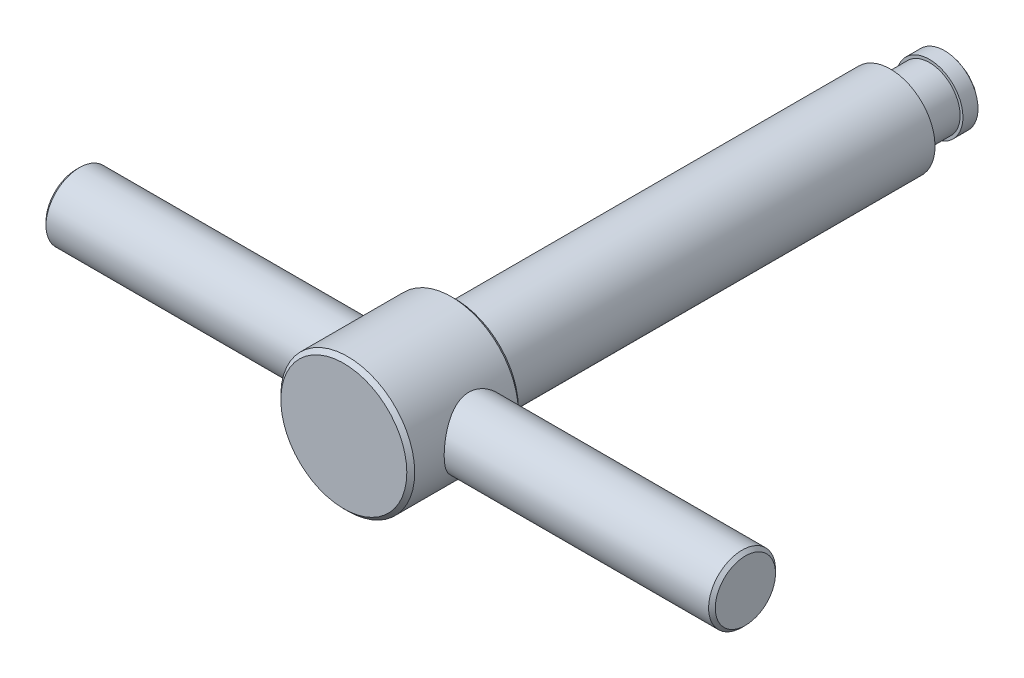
ISO-10303-21;
HEADER;
FILE_DESCRIPTION(('STEP AP214'),'2;1');
FILE_NAME('part.step','',(''),(''),'','','');
FILE_SCHEMA(('AUTOMOTIVE_DESIGN { 1 0 10303 214 1 1 1 1 }'));
ENDSEC;
DATA;
#1=APPLICATION_CONTEXT('core data for automotive mechanical design processes');
#2=APPLICATION_PROTOCOL_DEFINITION('international standard','automotive_design',2000,#1);
#3=PRODUCT_CONTEXT('',#1,'mechanical');
#4=PRODUCT('Part','Part','',(#3));
#5=PRODUCT_RELATED_PRODUCT_CATEGORY('part','',(#4));
#6=PRODUCT_DEFINITION_FORMATION('','',#4);
#7=PRODUCT_DEFINITION_CONTEXT('part definition',#1,'design');
#8=PRODUCT_DEFINITION('design','',#6,#7);
#9=PRODUCT_DEFINITION_SHAPE('','',#8);
#10=(LENGTH_UNIT() NAMED_UNIT(*) SI_UNIT(.MILLI.,.METRE.));
#11=(NAMED_UNIT(*) PLANE_ANGLE_UNIT() SI_UNIT($,.RADIAN.));
#12=(NAMED_UNIT(*) SI_UNIT($,.STERADIAN.) SOLID_ANGLE_UNIT());
#13=UNCERTAINTY_MEASURE_WITH_UNIT(LENGTH_MEASURE(1.E-05),#10,'distance_accuracy_value','');
#14=(GEOMETRIC_REPRESENTATION_CONTEXT(3) GLOBAL_UNCERTAINTY_ASSIGNED_CONTEXT((#13)) GLOBAL_UNIT_ASSIGNED_CONTEXT((#10,
#11,#12)) REPRESENTATION_CONTEXT('',''));
#15=CARTESIAN_POINT('',(0.,0.,0.));
#16=DIRECTION('',(0.,0.,1.));
#17=DIRECTION('',(1.,0.,0.));
#18=AXIS2_PLACEMENT_3D('',#15,#16,#17);
#19=CARTESIAN_POINT('',(60.,0.,103.4));
#20=DIRECTION('',(-1.,0.,0.));
#21=DIRECTION('',(0.,-1.,0.));
#22=AXIS2_PLACEMENT_3D('',#19,#20,#21);
#23=PLANE('',#22);
#24=CARTESIAN_POINT('',(60.0000000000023,0.,98.));
#25=DIRECTION('',(-1.,0.,0.));
#26=DIRECTION('',(0.,-1.,0.));
#27=AXIS2_PLACEMENT_3D('',#24,#25,#26);
#28=CIRCLE('',#27,5.40000000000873);
#29=CARTESIAN_POINT('',(60.0000000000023,-5.40000000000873,98.));
#30=VERTEX_POINT('',#29);
#31=EDGE_CURVE('E15',#30,#30,#28,.T.);
#32=ORIENTED_EDGE('',*,*,#31,.F.);
#33=EDGE_LOOP('',(#32));
#34=FACE_BOUND('',#33,.T.);
#35=ADVANCED_FACE('F12',(#34),#23,.F.);
#36=CARTESIAN_POINT('',(-60.,0.,98.));
#37=DIRECTION('',(1.,0.,0.));
#38=DIRECTION('',(0.,1.,0.));
#39=AXIS2_PLACEMENT_3D('',#36,#37,#38);
#40=PLANE('',#39);
#41=CARTESIAN_POINT('',(-60.0000000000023,0.,98.));
#42=DIRECTION('',(1.,0.,0.));
#43=DIRECTION('',(0.,1.,0.));
#44=AXIS2_PLACEMENT_3D('',#41,#42,#43);
#45=CIRCLE('',#44,5.40000000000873);
#46=CARTESIAN_POINT('',(-60.0000000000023,5.40000000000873,98.));
#47=VERTEX_POINT('',#46);
#48=EDGE_CURVE('E133',#47,#47,#45,.T.);
#49=ORIENTED_EDGE('',*,*,#48,.F.);
#50=EDGE_LOOP('',(#49));
#51=FACE_BOUND('',#50,.T.);
#52=ADVANCED_FACE('F171',(#51),#40,.F.);
#53=CARTESIAN_POINT('',(0.,0.,9.));
#54=DIRECTION('',(-1.,0.,0.));
#55=DIRECTION('',(0.,1.,0.));
#56=AXIS2_PLACEMENT_3D('',#53,#54,#55);
#57=SPHERICAL_SURFACE('',#56,9.);
#58=CARTESIAN_POINT('',(0.,0.,2.29179606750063));
#59=DIRECTION('',(0.,0.,1.));
#60=DIRECTION('',(0.,-1.,0.));
#61=AXIS2_PLACEMENT_3D('',#58,#59,#60);
#62=CIRCLE('',#61,6.);
#63=CARTESIAN_POINT('',(0.,-6.,2.29179606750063));
#64=VERTEX_POINT('',#63);
#65=EDGE_CURVE('E126',#64,#64,#62,.T.);
#66=ORIENTED_EDGE('',*,*,#65,.F.);
#67=EDGE_LOOP('',(#66));
#68=FACE_BOUND('',#67,.T.);
#69=ADVANCED_FACE('F168',(#68),#57,.T.);
#70=CARTESIAN_POINT('',(59.3999999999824,0.,98.));
#71=DIRECTION('',(-1.,0.,0.));
#72=DIRECTION('',(0.,-1.,0.));
#73=AXIS2_PLACEMENT_3D('',#70,#71,#72);
#74=CONICAL_SURFACE('',#73,5.99999999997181,0.785398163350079);
#75=CARTESIAN_POINT('',(59.4,0.,98.));
#76=DIRECTION('',(-1.,0.,0.));
#77=DIRECTION('',(0.,-1.,0.));
#78=AXIS2_PLACEMENT_3D('',#75,#76,#77);
#79=CIRCLE('',#78,6.);
#80=CARTESIAN_POINT('',(59.4,-6.,98.));
#81=VERTEX_POINT('',#80);
#82=EDGE_CURVE('E124',#81,#81,#79,.T.);
#83=ORIENTED_EDGE('',*,*,#82,.F.);
#84=EDGE_LOOP('',(#83));
#85=FACE_BOUND('',#84,.T.);
#86=ORIENTED_EDGE('',*,*,#31,.T.);
#87=EDGE_LOOP('',(#86));
#88=FACE_BOUND('',#87,.T.);
#89=ADVANCED_FACE('F164',(#85,#88),#74,.T.);
#90=CARTESIAN_POINT('',(0.,0.,110.));
#91=DIRECTION('',(0.,0.,-1.));
#92=DIRECTION('',(0.,1.,0.));
#93=AXIS2_PLACEMENT_3D('',#90,#91,#92);
#94=PLANE('',#93);
#95=CARTESIAN_POINT('',(0.,0.,110.));
#96=DIRECTION('',(0.,0.,-1.));
#97=DIRECTION('',(1.,0.,0.));
#98=AXIS2_PLACEMENT_3D('',#95,#96,#97);
#99=CIRCLE('',#98,11.2928932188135);
#100=CARTESIAN_POINT('',(11.2928932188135,0.,110.));
#101=VERTEX_POINT('',#100);
#102=EDGE_CURVE('E121',#101,#101,#99,.T.);
#103=ORIENTED_EDGE('',*,*,#102,.F.);
#104=EDGE_LOOP('',(#103));
#105=FACE_BOUND('',#104,.T.);
#106=ADVANCED_FACE('F160',(#105),#94,.F.);
#107=CARTESIAN_POINT('',(-59.400000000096,0.,98.));
#108=DIRECTION('',(1.,0.,0.));
#109=DIRECTION('',(0.,1.,0.));
#110=AXIS2_PLACEMENT_3D('',#107,#108,#109);
#111=CONICAL_SURFACE('',#110,5.99999999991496,0.785398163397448);
#112=ORIENTED_EDGE('',*,*,#48,.T.);
#113=EDGE_LOOP('',(#112));
#114=FACE_BOUND('',#113,.T.);
#115=CARTESIAN_POINT('',(-59.4,0.,98.));
#116=DIRECTION('',(-1.,0.,0.));
#117=DIRECTION('',(0.,-1.,0.));
#118=AXIS2_PLACEMENT_3D('',#115,#116,#117);
#119=CIRCLE('',#118,6.);
#120=CARTESIAN_POINT('',(-59.4,-6.,98.));
#121=VERTEX_POINT('',#120);
#122=EDGE_CURVE('E117',#121,#121,#119,.F.);
#123=ORIENTED_EDGE('',*,*,#122,.F.);
#124=EDGE_LOOP('',(#123));
#125=FACE_BOUND('',#124,.T.);
#126=ADVANCED_FACE('F154',(#114,#125),#111,.T.);
#127=CARTESIAN_POINT('',(0.,0.,0.));
#128=DIRECTION('',(0.,0.,1.));
#129=DIRECTION('',(0.,-1.,0.));
#130=AXIS2_PLACEMENT_3D('',#127,#128,#129);
#131=CYLINDRICAL_SURFACE('',#130,6.);
#132=CARTESIAN_POINT('',(0.,0.,5.));
#133=DIRECTION('',(0.,0.,1.));
#134=DIRECTION('',(0.,-1.,0.));
#135=AXIS2_PLACEMENT_3D('',#132,#133,#134);
#136=CIRCLE('',#135,6.);
#137=CARTESIAN_POINT('',(0.,-6.,5.));
#138=VERTEX_POINT('',#137);
#139=EDGE_CURVE('E120',#138,#138,#136,.F.);
#140=ORIENTED_EDGE('',*,*,#139,.T.);
#141=EDGE_LOOP('',(#140));
#142=FACE_BOUND('',#141,.T.);
#143=ORIENTED_EDGE('',*,*,#65,.T.);
#144=EDGE_LOOP('',(#143));
#145=FACE_BOUND('',#144,.T.);
#146=ADVANCED_FACE('F147',(#142,#145),#131,.T.);
#147=CARTESIAN_POINT('',(60.,0.,98.));
#148=DIRECTION('',(-1.,0.,0.));
#149=DIRECTION('',(0.,-1.,0.));
#150=AXIS2_PLACEMENT_3D('',#147,#148,#149);
#151=CYLINDRICAL_SURFACE('',#150,6.);
#152=CARTESIAN_POINT('',(10.396729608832,5.99232955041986,97.6967071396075));
#153=CARTESIAN_POINT('',(10.4013641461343,5.9842898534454,97.5378840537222));
#154=CARTESIAN_POINT('',(10.4096334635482,5.96993301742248,97.3794639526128));
#155=CARTESIAN_POINT('',(10.4331256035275,5.92878096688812,97.064706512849));
#156=CARTESIAN_POINT('',(10.4483521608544,5.90197907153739,96.9083703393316));
#157=CARTESIAN_POINT('',(10.4852220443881,5.83622654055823,96.5987339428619));
#158=CARTESIAN_POINT('',(10.5068773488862,5.79725321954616,96.4454399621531));
#159=CARTESIAN_POINT('',(10.5558238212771,5.70764223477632,96.1431995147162));
#160=CARTESIAN_POINT('',(10.5831175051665,5.65699936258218,95.9942550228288));
#161=CARTESIAN_POINT('',(10.6717668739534,5.48902587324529,95.5571602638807));
#162=CARTESIAN_POINT('',(10.7401681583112,5.35518386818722,95.2765932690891));
#163=CARTESIAN_POINT('',(10.8880451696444,5.04771900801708,94.7418006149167));
#164=CARTESIAN_POINT('',(10.9675203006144,4.87409829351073,94.4875735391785));
#165=CARTESIAN_POINT('',(11.1370713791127,4.47402221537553,93.9882416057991));
#166=CARTESIAN_POINT('',(11.2274666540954,4.24427471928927,93.7458775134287));
#167=CARTESIAN_POINT('',(11.4032291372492,3.74644538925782,93.3015590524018));
#168=CARTESIAN_POINT('',(11.4885943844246,3.47834874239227,93.0996203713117));
#169=CARTESIAN_POINT('',(11.6079649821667,3.04611998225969,92.8277879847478));
#170=CARTESIAN_POINT('',(11.6469747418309,2.89375494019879,92.740999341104));
#171=CARTESIAN_POINT('',(11.720220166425,2.58111511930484,92.5807143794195));
#172=CARTESIAN_POINT('',(11.7544578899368,2.42084379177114,92.5072123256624));
#173=CARTESIAN_POINT('',(11.8171423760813,2.0935399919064,92.3743192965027));
#174=CARTESIAN_POINT('',(11.8455915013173,1.92651031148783,92.3149225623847));
#175=CARTESIAN_POINT('',(11.8958437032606,1.58692880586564,92.210943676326));
#176=CARTESIAN_POINT('',(11.9176475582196,1.41437762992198,92.1663597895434));
#177=CARTESIAN_POINT('',(11.9523359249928,1.08044086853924,92.0958329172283));
#178=CARTESIAN_POINT('',(11.9658310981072,0.919388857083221,92.0686062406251));
#179=CARTESIAN_POINT('',(11.9863301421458,0.59519752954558,92.0273596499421));
#180=CARTESIAN_POINT('',(11.9933345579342,0.432058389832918,92.0133386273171));
#181=CARTESIAN_POINT('',(12.0006537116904,0.105088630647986,91.9986893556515));
#182=CARTESIAN_POINT('',(12.000970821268,-0.058741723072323,91.9980563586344));
#183=CARTESIAN_POINT('',(11.9949122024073,-0.385778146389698,92.0101797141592));
#184=CARTESIAN_POINT('',(11.9885367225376,-0.548984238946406,92.0229355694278));
#185=CARTESIAN_POINT('',(11.9699803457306,-0.861547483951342,92.0602468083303));
#186=CARTESIAN_POINT('',(11.9582582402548,-1.01104436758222,92.0838707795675));
#187=CARTESIAN_POINT('',(11.9294981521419,-1.30738064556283,92.1422213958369));
#188=CARTESIAN_POINT('',(11.9124584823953,-1.45421918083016,92.1769515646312));
#189=CARTESIAN_POINT('',(11.8734615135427,-1.74421949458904,92.2571507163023));
#190=CARTESIAN_POINT('',(11.8515056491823,-1.88738233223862,92.3026165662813));
#191=CARTESIAN_POINT('',(11.8031687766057,-2.16926380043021,92.4038621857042));
#192=CARTESIAN_POINT('',(11.7767860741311,-2.30798070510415,92.4596459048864));
#193=CARTESIAN_POINT('',(11.6898816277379,-2.72563439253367,92.6459566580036));
#194=CARTESIAN_POINT('',(11.6229758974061,-2.99621625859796,92.7927137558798));
#195=CARTESIAN_POINT('',(11.4783693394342,-3.50976933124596,93.1240252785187));
#196=CARTESIAN_POINT('',(11.4006635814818,-3.75272783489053,93.308596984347));
#197=CARTESIAN_POINT('',(11.232947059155,-4.22976715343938,93.7314543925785));
#198=CARTESIAN_POINT('',(11.1424800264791,-4.46058169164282,93.9732506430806));
#199=CARTESIAN_POINT('',(10.9653912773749,-4.87976233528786,94.4929605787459));
#200=CARTESIAN_POINT('',(10.8787720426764,-5.0681013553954,94.7708971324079));
#201=CARTESIAN_POINT('',(10.7575950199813,-5.31819877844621,95.2165709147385));
#202=CARTESIAN_POINT('',(10.7179644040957,-5.39739296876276,95.373371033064));
#203=CARTESIAN_POINT('',(10.6438649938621,-5.54208804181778,95.6943115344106));
#204=CARTESIAN_POINT('',(10.6093937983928,-5.60759529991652,95.8584484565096));
#205=CARTESIAN_POINT('',(10.5469857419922,-5.72411263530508,96.1928308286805));
#206=CARTESIAN_POINT('',(10.5190431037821,-5.77513553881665,96.3630707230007));
#207=CARTESIAN_POINT('',(10.4708608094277,-5.86204340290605,96.7084371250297));
#208=CARTESIAN_POINT('',(10.4506199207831,-5.8979307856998,96.883562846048));
#209=CARTESIAN_POINT('',(10.420411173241,-5.95112289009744,97.2190020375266));
#210=CARTESIAN_POINT('',(10.4096046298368,-5.96995227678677,97.3789994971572));
#211=CARTESIAN_POINT('',(10.3953867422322,-5.99467617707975,97.7003127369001));
#212=CARTESIAN_POINT('',(10.391974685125,-6.00057193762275,97.8616283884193));
#213=CARTESIAN_POINT('',(10.3926854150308,-5.99934075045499,98.1841480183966));
#214=CARTESIAN_POINT('',(10.3968061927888,-5.99221727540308,98.3453520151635));
#215=CARTESIAN_POINT('',(10.4124091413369,-5.96506323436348,98.6663014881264));
#216=CARTESIAN_POINT('',(10.4238910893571,-5.94503305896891,98.8260470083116));
#217=CARTESIAN_POINT('',(10.4524366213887,-5.89468609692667,99.1287553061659));
#218=CARTESIAN_POINT('',(10.4689163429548,-5.86543648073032,99.2719522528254));
#219=CARTESIAN_POINT('',(10.5070880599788,-5.79677768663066,99.5551948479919));
#220=CARTESIAN_POINT('',(10.5287816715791,-5.75736535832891,99.6952395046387));
#221=CARTESIAN_POINT('',(10.6007490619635,-5.62444241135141,100.109406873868));
#222=CARTESIAN_POINT('',(10.6579286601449,-5.51621366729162,100.377753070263));
#223=CARTESIAN_POINT('',(10.7895116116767,-5.25445945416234,100.9130963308));
#224=CARTESIAN_POINT('',(10.8648878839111,-5.09813619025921,101.178469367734));
#225=CARTESIAN_POINT('',(11.0223936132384,-4.7480259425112,101.681056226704));
#226=CARTESIAN_POINT('',(11.1045270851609,-4.55421659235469,101.918253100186));
#227=CARTESIAN_POINT('',(11.2779849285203,-4.10741265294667,102.387013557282));
#228=CARTESIAN_POINT('',(11.3692423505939,-3.85012262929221,102.614562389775));
#229=CARTESIAN_POINT('',(11.4983181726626,-3.43652386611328,102.921370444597));
#230=CARTESIAN_POINT('',(11.5400655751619,-3.2939483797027,103.017937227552));
#231=CARTESIAN_POINT('',(11.6198691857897,-3.00028881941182,103.198842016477));
#232=CARTESIAN_POINT('',(11.6579271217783,-2.84920878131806,103.283185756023));
#233=CARTESIAN_POINT('',(11.7292455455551,-2.53968300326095,103.438747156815));
#234=CARTESIAN_POINT('',(11.7625139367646,-2.38124998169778,103.509986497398));
#235=CARTESIAN_POINT('',(11.823367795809,-2.05791468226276,103.638727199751));
#236=CARTESIAN_POINT('',(11.8509559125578,-1.89301546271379,103.696234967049));
#237=CARTESIAN_POINT('',(11.8996299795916,-1.55802349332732,103.796820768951));
#238=CARTESIAN_POINT('',(11.9207192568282,-1.38793345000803,103.839906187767));
#239=CARTESIAN_POINT('',(11.9557555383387,-1.04392825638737,103.911095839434));
#240=CARTESIAN_POINT('',(11.9697033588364,-0.87001354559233,103.939201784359));
#241=CARTESIAN_POINT('',(11.9890057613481,-0.537308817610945,103.97800203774));
#242=CARTESIAN_POINT('',(11.9950748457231,-0.378727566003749,103.990145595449));
#243=CARTESIAN_POINT('',(12.0008966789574,-0.0609889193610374,104.001795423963));
#244=CARTESIAN_POINT('',(12.0006498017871,0.0981684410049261,104.001302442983));
#245=CARTESIAN_POINT('',(11.9938467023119,0.415774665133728,103.987686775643));
#246=CARTESIAN_POINT('',(11.9872916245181,0.574223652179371,103.974566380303));
#247=CARTESIAN_POINT('',(11.9680493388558,0.889210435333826,103.935864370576));
#248=CARTESIAN_POINT('',(11.9553621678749,1.04574824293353,103.91028283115));
#249=CARTESIAN_POINT('',(11.9249214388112,1.34843417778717,103.848456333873));
#250=CARTESIAN_POINT('',(11.9074352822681,1.4947239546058,103.812771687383));
#251=CARTESIAN_POINT('',(11.8676036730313,1.78361750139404,103.730731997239));
#252=CARTESIAN_POINT('',(11.8452566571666,1.92622006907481,103.684373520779));
#253=CARTESIAN_POINT('',(11.7716506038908,2.34715104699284,103.529923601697));
#254=CARTESIAN_POINT('',(11.7138014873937,2.61884038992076,103.406408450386));
#255=CARTESIAN_POINT('',(11.5814931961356,3.15433303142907,103.113610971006));
#256=CARTESIAN_POINT('',(11.5062385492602,3.4166549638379,102.942004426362));
#257=CARTESIAN_POINT('',(11.3480294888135,3.910174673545,102.56155109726));
#258=CARTESIAN_POINT('',(11.2650706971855,4.14135456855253,102.352683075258));
#259=CARTESIAN_POINT('',(11.0904884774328,4.58959419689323,101.879657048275));
#260=CARTESIAN_POINT('',(10.9988086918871,4.80308099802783,101.612094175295));
#261=CARTESIAN_POINT('',(10.8685825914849,5.08771873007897,101.185044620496));
#262=CARTESIAN_POINT('',(10.8263558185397,5.17672801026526,101.038271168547));
#263=CARTESIAN_POINT('',(10.7456657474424,5.34220185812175,100.736857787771));
#264=CARTESIAN_POINT('',(10.707200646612,5.41867244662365,100.582221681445));
#265=CARTESIAN_POINT('',(10.6351987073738,5.55866739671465,100.265252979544));
#266=CARTESIAN_POINT('',(10.601683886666,5.62213437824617,100.102890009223));
#267=CARTESIAN_POINT('',(10.5410848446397,5.73494845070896,99.7722447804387));
#268=CARTESIAN_POINT('',(10.5139971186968,5.78430323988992,99.6039658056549));
#269=CARTESIAN_POINT('',(10.4674355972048,5.86814204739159,99.2631789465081));
#270=CARTESIAN_POINT('',(10.4479420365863,5.90266469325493,99.0906832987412));
#271=CARTESIAN_POINT('',(10.4173697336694,5.95645689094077,98.7426839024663));
#272=CARTESIAN_POINT('',(10.4062850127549,5.97573728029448,98.5671823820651));
#273=CARTESIAN_POINT('',(10.3953148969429,5.99478823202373,98.2755481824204));
#274=CARTESIAN_POINT('',(10.3928876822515,5.99899031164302,98.15977751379));
#275=CARTESIAN_POINT('',(10.3919080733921,6.00068740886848,97.9281690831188));
#276=CARTESIAN_POINT('',(10.3933556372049,5.99818249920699,97.8123313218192));
#277=CARTESIAN_POINT('',(10.396729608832,5.99232955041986,97.6967071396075));
#278=B_SPLINE_CURVE_WITH_KNOTS('',3,(#152,#153,#154,#155,#156,#157,#158,#159,#160,#161,#162,
#163,#164,#165,#166,#167,#168,#169,#170,#171,#172,#173,#174,#175,#176,#177,#178,#179,#180,#181,
#182,#183,#184,#185,#186,#187,#188,#189,#190,#191,#192,#193,#194,#195,#196,#197,#198,#199,#200,
#201,#202,#203,#204,#205,#206,#207,#208,#209,#210,#211,#212,#213,#214,#215,#216,#217,#218,#219,
#220,#221,#222,#223,#224,#225,#226,#227,#228,#229,#230,#231,#232,#233,#234,#235,#236,#237,#238,
#239,#240,#241,#242,#243,#244,#245,#246,#247,#248,#249,#250,#251,#252,#253,#254,#255,#256,#257,
#258,#259,#260,#261,#262,#263,#264,#265,#266,#267,#268,#269,#270,#271,#272,#273,#274,#275,#276,
#277),.UNSPECIFIED.,.T.,.F.,(4,2,2,2,2,2,2,2,2,2,2,2,2,2,2,2,2,2,2,2,2,2,2,2,2,2,2,2,2,2,2,2,2,
2,2,2,2,2,2,2,2,2,2,2,2,2,2,2,2,2,2,2,2,2,2,2,2,2,2,2,2,2,4),(0.,0.477157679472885,
0.954571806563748,1.43288111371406,1.91140431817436,2.86186573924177,3.8122760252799,
4.84577885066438,5.87968196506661,6.41798239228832,6.95604988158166,7.49389731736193,
8.03168173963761,8.52270914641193,9.01369533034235,9.50450738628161,9.995301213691,
10.4501927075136,10.905228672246,11.3601320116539,11.8152098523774,12.7559779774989,
13.6971769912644,14.7316562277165,15.7667932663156,16.3064145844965,16.8457839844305,
17.3846742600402,17.923478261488,18.4071994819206,18.8908740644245,19.3744196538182,
19.8579506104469,20.2986917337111,20.739569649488,21.6207508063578,22.5683036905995,
23.5164236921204,24.5771474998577,25.1081792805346,25.6389611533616,26.1688568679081,
26.6985049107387,27.2278813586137,27.7571972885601,28.2340678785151,28.7109102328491,
29.187666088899,29.6644190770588,30.1186690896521,30.5730653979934,31.4811344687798,
32.4443599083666,33.4081361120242,34.4658570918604,34.9956433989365,35.5251745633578,
36.0569942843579,36.5885233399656,37.1186596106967,37.6484186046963,37.9957960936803,
38.3431698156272),.UNSPECIFIED.);
#279=CARTESIAN_POINT('',(10.396729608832,5.99232955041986,97.6967071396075));
#280=VERTEX_POINT('',#279);
#281=EDGE_CURVE('E46',#280,#280,#278,.T.);
#282=ORIENTED_EDGE('',*,*,#281,.F.);
#283=EDGE_LOOP('',(#282));
#284=FACE_BOUND('',#283,.T.);
#285=ORIENTED_EDGE('',*,*,#82,.T.);
#286=EDGE_LOOP('',(#285));
#287=FACE_BOUND('',#286,.T.);
#288=ADVANCED_FACE('F145',(#284,#287),#151,.T.);
#289=CARTESIAN_POINT('',(0.,0.,109.292893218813));
#290=DIRECTION('',(0.,0.,-1.));
#291=DIRECTION('',(1.,0.,0.));
#292=AXIS2_PLACEMENT_3D('',#289,#290,#291);
#293=CONICAL_SURFACE('',#292,12.0000000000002,0.78539816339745);
#294=ORIENTED_EDGE('',*,*,#102,.T.);
#295=EDGE_LOOP('',(#294));
#296=FACE_BOUND('',#295,.T.);
#297=CARTESIAN_POINT('',(0.,0.,109.292893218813));
#298=DIRECTION('',(0.,0.,1.));
#299=DIRECTION('',(0.,-1.,0.));
#300=AXIS2_PLACEMENT_3D('',#297,#298,#299);
#301=CIRCLE('',#300,12.);
#302=CARTESIAN_POINT('',(0.,-12.,109.292893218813));
#303=VERTEX_POINT('',#302);
#304=EDGE_CURVE('E45',#303,#303,#301,.F.);
#305=ORIENTED_EDGE('',*,*,#304,.F.);
#306=EDGE_LOOP('',(#305));
#307=FACE_BOUND('',#306,.T.);
#308=ADVANCED_FACE('F72',(#296,#307),#293,.T.);
#309=CARTESIAN_POINT('',(60.,0.,98.));
#310=DIRECTION('',(-1.,0.,0.));
#311=DIRECTION('',(0.,-1.,0.));
#312=AXIS2_PLACEMENT_3D('',#309,#310,#311);
#313=CYLINDRICAL_SURFACE('',#312,6.);
#314=ORIENTED_EDGE('',*,*,#122,.T.);
#315=EDGE_LOOP('',(#314));
#316=FACE_BOUND('',#315,.T.);
#317=CARTESIAN_POINT('',(-10.396729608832,5.99232955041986,98.3032928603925));
#318=CARTESIAN_POINT('',(-10.4013641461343,5.98428985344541,98.4621159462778));
#319=CARTESIAN_POINT('',(-10.4096334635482,5.96993301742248,98.6205360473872));
#320=CARTESIAN_POINT('',(-10.4331256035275,5.92878096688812,98.935293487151));
#321=CARTESIAN_POINT('',(-10.4483521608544,5.90197907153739,99.0916296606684));
#322=CARTESIAN_POINT('',(-10.4852220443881,5.83622654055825,99.401266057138));
#323=CARTESIAN_POINT('',(-10.5068773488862,5.79725321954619,99.5545600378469));
#324=CARTESIAN_POINT('',(-10.5558238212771,5.70764223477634,99.8568004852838));
#325=CARTESIAN_POINT('',(-10.5831175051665,5.65699936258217,100.005744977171));
#326=CARTESIAN_POINT('',(-10.6717668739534,5.48902587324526,100.442839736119));
#327=CARTESIAN_POINT('',(-10.7401681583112,5.35518386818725,100.723406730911));
#328=CARTESIAN_POINT('',(-10.8880451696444,5.04771900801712,101.258199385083));
#329=CARTESIAN_POINT('',(-10.9675203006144,4.87409829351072,101.512426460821));
#330=CARTESIAN_POINT('',(-11.1370713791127,4.47402221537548,102.011758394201));
#331=CARTESIAN_POINT('',(-11.2274666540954,4.24427471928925,102.254122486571));
#332=CARTESIAN_POINT('',(-11.4032291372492,3.74644538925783,102.698440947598));
#333=CARTESIAN_POINT('',(-11.4885943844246,3.47834874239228,102.900379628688));
#334=CARTESIAN_POINT('',(-11.6079649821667,3.04611998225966,103.172212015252));
#335=CARTESIAN_POINT('',(-11.6469747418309,2.89375494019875,103.259000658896));
#336=CARTESIAN_POINT('',(-11.720220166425,2.58111511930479,103.41928562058));
#337=CARTESIAN_POINT('',(-11.7544578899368,2.42084379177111,103.492787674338));
#338=CARTESIAN_POINT('',(-11.8171423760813,2.09353999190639,103.625680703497));
#339=CARTESIAN_POINT('',(-11.8455915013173,1.92651031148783,103.685077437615));
#340=CARTESIAN_POINT('',(-11.8958437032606,1.58692880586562,103.789056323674));
#341=CARTESIAN_POINT('',(-11.9176475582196,1.41437762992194,103.833640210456));
#342=CARTESIAN_POINT('',(-11.9523359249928,1.08044086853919,103.904167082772));
#343=CARTESIAN_POINT('',(-11.9658310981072,0.919388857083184,103.931393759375));
#344=CARTESIAN_POINT('',(-11.9863301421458,0.59519752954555,103.972640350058));
#345=CARTESIAN_POINT('',(-11.9933345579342,0.432058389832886,103.986661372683));
#346=CARTESIAN_POINT('',(-12.0006537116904,0.105088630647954,104.001310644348));
#347=CARTESIAN_POINT('',(-12.000970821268,-0.0587417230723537,104.001943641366));
#348=CARTESIAN_POINT('',(-11.9949122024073,-0.385778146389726,103.989820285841));
#349=CARTESIAN_POINT('',(-11.9885367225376,-0.548984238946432,103.977064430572));
#350=CARTESIAN_POINT('',(-11.9699803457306,-0.861547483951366,103.93975319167));
#351=CARTESIAN_POINT('',(-11.9582582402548,-1.01104436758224,103.916129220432));
#352=CARTESIAN_POINT('',(-11.9294981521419,-1.30738064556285,103.857778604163));
#353=CARTESIAN_POINT('',(-11.9124584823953,-1.45421918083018,103.823048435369));
#354=CARTESIAN_POINT('',(-11.8734615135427,-1.74421949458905,103.742849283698));
#355=CARTESIAN_POINT('',(-11.8515056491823,-1.88738233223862,103.697383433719));
#356=CARTESIAN_POINT('',(-11.8031687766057,-2.16926380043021,103.596137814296));
#357=CARTESIAN_POINT('',(-11.7767860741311,-2.30798070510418,103.540354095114));
#358=CARTESIAN_POINT('',(-11.6898816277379,-2.72563439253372,103.354043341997));
#359=CARTESIAN_POINT('',(-11.6229758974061,-2.99621625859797,103.20728624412));
#360=CARTESIAN_POINT('',(-11.4783693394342,-3.50976933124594,102.875974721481));
#361=CARTESIAN_POINT('',(-11.4006635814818,-3.75272783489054,102.691403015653));
#362=CARTESIAN_POINT('',(-11.232947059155,-4.22976715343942,102.268545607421));
#363=CARTESIAN_POINT('',(-11.1424800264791,-4.46058169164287,102.026749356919));
#364=CARTESIAN_POINT('',(-10.9653912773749,-4.87976233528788,101.507039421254));
#365=CARTESIAN_POINT('',(-10.8787720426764,-5.0681013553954,101.229102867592));
#366=CARTESIAN_POINT('',(-10.7575950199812,-5.31819877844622,100.783429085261));
#367=CARTESIAN_POINT('',(-10.7179644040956,-5.39739296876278,100.626628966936));
#368=CARTESIAN_POINT('',(-10.6438649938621,-5.5420880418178,100.305688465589));
#369=CARTESIAN_POINT('',(-10.6093937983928,-5.60759529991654,100.14155154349));
#370=CARTESIAN_POINT('',(-10.5469857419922,-5.72411263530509,99.8071691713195));
#371=CARTESIAN_POINT('',(-10.5190431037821,-5.77513553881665,99.6369292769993));
#372=CARTESIAN_POINT('',(-10.4708608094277,-5.86204340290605,99.2915628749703));
#373=CARTESIAN_POINT('',(-10.4506199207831,-5.89793078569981,99.116437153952));
#374=CARTESIAN_POINT('',(-10.420411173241,-5.95112289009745,98.7809979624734));
#375=CARTESIAN_POINT('',(-10.4096046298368,-5.96995227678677,98.6210005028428));
#376=CARTESIAN_POINT('',(-10.3953867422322,-5.99467617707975,98.2996872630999));
#377=CARTESIAN_POINT('',(-10.391974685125,-6.00057193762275,98.1383716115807));
#378=CARTESIAN_POINT('',(-10.3926854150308,-5.99934075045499,97.8158519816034));
#379=CARTESIAN_POINT('',(-10.3968061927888,-5.99221727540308,97.6546479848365));
#380=CARTESIAN_POINT('',(-10.4124091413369,-5.96506323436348,97.3336985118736));
#381=CARTESIAN_POINT('',(-10.4238910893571,-5.94503305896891,97.1739529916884));
#382=CARTESIAN_POINT('',(-10.4524366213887,-5.89468609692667,96.8712446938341));
#383=CARTESIAN_POINT('',(-10.4689163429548,-5.86543648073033,96.7280477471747));
#384=CARTESIAN_POINT('',(-10.5070880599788,-5.79677768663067,96.4448051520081));
#385=CARTESIAN_POINT('',(-10.5287816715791,-5.75736535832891,96.3047604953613));
#386=CARTESIAN_POINT('',(-10.6007490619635,-5.6244424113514,95.8905931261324));
#387=CARTESIAN_POINT('',(-10.6579286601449,-5.51621366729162,95.6222469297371));
#388=CARTESIAN_POINT('',(-10.7895116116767,-5.25445945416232,95.0869036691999));
#389=CARTESIAN_POINT('',(-10.8648878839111,-5.09813619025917,94.8215306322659));
#390=CARTESIAN_POINT('',(-11.0223936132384,-4.74802594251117,94.3189437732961));
#391=CARTESIAN_POINT('',(-11.1045270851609,-4.55421659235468,94.0817468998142));
#392=CARTESIAN_POINT('',(-11.2779849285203,-4.10741265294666,93.6129864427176));
#393=CARTESIAN_POINT('',(-11.3692423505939,-3.85012262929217,93.385437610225));
#394=CARTESIAN_POINT('',(-11.4983181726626,-3.43652386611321,93.0786295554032));
#395=CARTESIAN_POINT('',(-11.5400655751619,-3.29394837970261,92.9820627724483));
#396=CARTESIAN_POINT('',(-11.6198691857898,-3.00028881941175,92.8011579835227));
#397=CARTESIAN_POINT('',(-11.6579271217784,-2.84920878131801,92.7168142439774));
#398=CARTESIAN_POINT('',(-11.7292455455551,-2.5396830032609,92.5612528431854));
#399=CARTESIAN_POINT('',(-11.7625139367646,-2.38124998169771,92.4900135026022));
#400=CARTESIAN_POINT('',(-11.823367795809,-2.05791468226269,92.3612728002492));
#401=CARTESIAN_POINT('',(-11.8509559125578,-1.89301546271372,92.303765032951));
#402=CARTESIAN_POINT('',(-11.8996299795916,-1.55802349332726,92.2031792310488));
#403=CARTESIAN_POINT('',(-11.9207192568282,-1.38793345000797,92.1600938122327));
#404=CARTESIAN_POINT('',(-11.9557555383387,-1.04392825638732,92.0889041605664));
#405=CARTESIAN_POINT('',(-11.9697033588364,-0.870013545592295,92.0607982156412));
#406=CARTESIAN_POINT('',(-11.9890057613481,-0.53730881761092,92.02199796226));
#407=CARTESIAN_POINT('',(-11.9950748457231,-0.378727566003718,92.0098544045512));
#408=CARTESIAN_POINT('',(-12.0008966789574,-0.0609889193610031,91.9982045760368));
#409=CARTESIAN_POINT('',(-12.0006498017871,0.098168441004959,91.998697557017));
#410=CARTESIAN_POINT('',(-11.9938467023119,0.415774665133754,92.0123132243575));
#411=CARTESIAN_POINT('',(-11.9872916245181,0.574223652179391,92.0254336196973));
#412=CARTESIAN_POINT('',(-11.9680493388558,0.88921043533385,92.0641356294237));
#413=CARTESIAN_POINT('',(-11.9553621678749,1.04574824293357,92.0897171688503));
#414=CARTESIAN_POINT('',(-11.9249214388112,1.3484341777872,92.1515436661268));
#415=CARTESIAN_POINT('',(-11.9074352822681,1.49472395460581,92.1872283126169));
#416=CARTESIAN_POINT('',(-11.8676036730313,1.78361750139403,92.2692680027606));
#417=CARTESIAN_POINT('',(-11.8452566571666,1.9262200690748,92.3156264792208));
#418=CARTESIAN_POINT('',(-11.7716506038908,2.34715104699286,92.4700763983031));
#419=CARTESIAN_POINT('',(-11.7138014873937,2.61884038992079,92.5935915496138));
#420=CARTESIAN_POINT('',(-11.5814931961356,3.15433303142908,92.8863890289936));
#421=CARTESIAN_POINT('',(-11.5062385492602,3.41665496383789,93.0579955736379));
#422=CARTESIAN_POINT('',(-11.3480294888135,3.910174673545,93.4384489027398));
#423=CARTESIAN_POINT('',(-11.2650706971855,4.14135456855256,93.6473169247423));
#424=CARTESIAN_POINT('',(-11.0904884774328,4.58959419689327,94.1203429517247));
#425=CARTESIAN_POINT('',(-10.9988086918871,4.80308099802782,94.3879058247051));
#426=CARTESIAN_POINT('',(-10.868582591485,5.08771873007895,94.8149553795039));
#427=CARTESIAN_POINT('',(-10.8263558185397,5.17672801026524,94.9617288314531));
#428=CARTESIAN_POINT('',(-10.7456657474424,5.34220185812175,95.2631422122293));
#429=CARTESIAN_POINT('',(-10.707200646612,5.41867244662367,95.4177783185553));
#430=CARTESIAN_POINT('',(-10.6351987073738,5.55866739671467,95.7347470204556));
#431=CARTESIAN_POINT('',(-10.601683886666,5.62213437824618,95.8971099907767));
#432=CARTESIAN_POINT('',(-10.5410848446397,5.73494845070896,96.2277552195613));
#433=CARTESIAN_POINT('',(-10.5139971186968,5.78430323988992,96.3960341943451));
#434=CARTESIAN_POINT('',(-10.4674355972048,5.86814204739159,96.7368210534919));
#435=CARTESIAN_POINT('',(-10.4479420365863,5.90266469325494,96.9093167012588));
#436=CARTESIAN_POINT('',(-10.4173697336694,5.95645689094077,97.2573160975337));
#437=CARTESIAN_POINT('',(-10.4062850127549,5.97573728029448,97.4328176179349));
#438=CARTESIAN_POINT('',(-10.3953148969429,5.99478823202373,97.7244518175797));
#439=CARTESIAN_POINT('',(-10.3928876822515,5.99899031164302,97.84022248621));
#440=CARTESIAN_POINT('',(-10.3919080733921,6.00068740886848,98.0718309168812));
#441=CARTESIAN_POINT('',(-10.3933556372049,5.99818249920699,98.1876686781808));
#442=CARTESIAN_POINT('',(-10.396729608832,5.99232955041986,98.3032928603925));
#443=B_SPLINE_CURVE_WITH_KNOTS('',3,(#317,#318,#319,#320,#321,#322,#323,#324,#325,#326,#327,
#328,#329,#330,#331,#332,#333,#334,#335,#336,#337,#338,#339,#340,#341,#342,#343,#344,#345,#346,
#347,#348,#349,#350,#351,#352,#353,#354,#355,#356,#357,#358,#359,#360,#361,#362,#363,#364,#365,
#366,#367,#368,#369,#370,#371,#372,#373,#374,#375,#376,#377,#378,#379,#380,#381,#382,#383,#384,
#385,#386,#387,#388,#389,#390,#391,#392,#393,#394,#395,#396,#397,#398,#399,#400,#401,#402,#403,
#404,#405,#406,#407,#408,#409,#410,#411,#412,#413,#414,#415,#416,#417,#418,#419,#420,#421,#422,
#423,#424,#425,#426,#427,#428,#429,#430,#431,#432,#433,#434,#435,#436,#437,#438,#439,#440,#441,
#442),.UNSPECIFIED.,.T.,.F.,(4,2,2,2,2,2,2,2,2,2,2,2,2,2,2,2,2,2,2,2,2,2,2,2,2,2,2,2,2,2,2,2,2,
2,2,2,2,2,2,2,2,2,2,2,2,2,2,2,2,2,2,2,2,2,2,2,2,2,2,2,2,2,4),(0.,0.477157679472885,
0.954571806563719,1.43288111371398,1.91140431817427,2.86186573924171,3.81227602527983,
4.84577885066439,5.87968196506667,6.41798239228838,6.95604988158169,7.49389731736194,
8.03168173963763,8.52270914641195,9.01369533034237,9.50450738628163,9.99530121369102,
10.4501927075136,10.905228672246,11.3601320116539,11.8152098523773,12.7559779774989,
13.6971769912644,14.7316562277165,15.7667932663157,16.3064145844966,16.8457839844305,
17.3846742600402,17.923478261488,18.4071994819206,18.8908740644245,19.3744196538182,
19.8579506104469,20.298691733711,20.739569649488,21.6207508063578,22.5683036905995,
23.5164236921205,24.5771474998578,25.1081792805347,25.6389611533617,26.1688568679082,
26.6985049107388,27.2278813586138,27.7571972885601,28.2340678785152,28.7109102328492,
29.187666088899,29.6644190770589,30.1186690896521,30.5730653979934,31.4811344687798,
32.4443599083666,33.4081361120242,34.4658570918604,34.9956433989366,35.5251745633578,
36.056994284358,36.5885233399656,37.1186596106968,37.6484186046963,37.9957960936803,
38.3431698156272),.UNSPECIFIED.);
#444=CARTESIAN_POINT('',(-10.396729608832,5.99232955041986,98.3032928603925));
#445=VERTEX_POINT('',#444);
#446=EDGE_CURVE('E37',#445,#445,#443,.T.);
#447=ORIENTED_EDGE('',*,*,#446,.F.);
#448=EDGE_LOOP('',(#447));
#449=FACE_BOUND('',#448,.T.);
#450=ADVANCED_FACE('F52',(#316,#449),#313,.T.);
#451=CARTESIAN_POINT('',(5.5,0.,5.));
#452=DIRECTION('',(0.,0.,-1.));
#453=DIRECTION('',(0.,1.,0.));
#454=AXIS2_PLACEMENT_3D('',#451,#452,#453);
#455=PLANE('',#454);
#456=CARTESIAN_POINT('',(0.,0.,5.));
#457=DIRECTION('',(0.,0.,1.));
#458=DIRECTION('',(0.,-1.,0.));
#459=AXIS2_PLACEMENT_3D('',#456,#457,#458);
#460=CIRCLE('',#459,5.5);
#461=CARTESIAN_POINT('',(0.,-5.5,5.));
#462=VERTEX_POINT('',#461);
#463=EDGE_CURVE('E33',#462,#462,#460,.T.);
#464=ORIENTED_EDGE('',*,*,#463,.F.);
#465=EDGE_LOOP('',(#464));
#466=FACE_BOUND('',#465,.T.);
#467=ORIENTED_EDGE('',*,*,#139,.F.);
#468=EDGE_LOOP('',(#467));
#469=FACE_BOUND('',#468,.T.);
#470=ADVANCED_FACE('F61',(#466,#469),#455,.F.);
#471=CARTESIAN_POINT('',(0.,0.,0.));
#472=DIRECTION('',(0.,0.,1.));
#473=DIRECTION('',(0.,-1.,0.));
#474=AXIS2_PLACEMENT_3D('',#471,#472,#473);
#475=CYLINDRICAL_SURFACE('',#474,12.);
#476=ORIENTED_EDGE('',*,*,#446,.T.);
#477=EDGE_LOOP('',(#476));
#478=FACE_BOUND('',#477,.T.);
#479=ORIENTED_EDGE('',*,*,#304,.T.);
#480=EDGE_LOOP('',(#479));
#481=FACE_BOUND('',#480,.T.);
#482=ORIENTED_EDGE('',*,*,#281,.T.);
#483=EDGE_LOOP('',(#482));
#484=FACE_BOUND('',#483,.T.);
#485=CARTESIAN_POINT('',(0.,0.,90.7071067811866));
#486=DIRECTION('',(0.,0.,1.));
#487=DIRECTION('',(0.,-1.,0.));
#488=AXIS2_PLACEMENT_3D('',#485,#486,#487);
#489=CIRCLE('',#488,12.);
#490=CARTESIAN_POINT('',(0.,-12.,90.7071067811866));
#491=VERTEX_POINT('',#490);
#492=EDGE_CURVE('E36',#491,#491,#489,.F.);
#493=ORIENTED_EDGE('',*,*,#492,.F.);
#494=EDGE_LOOP('',(#493));
#495=FACE_BOUND('',#494,.T.);
#496=ADVANCED_FACE('F56',(#478,#481,#484,#495),#475,.T.);
#497=CARTESIAN_POINT('',(0.,0.,0.));
#498=DIRECTION('',(0.,0.,1.));
#499=DIRECTION('',(0.,-1.,0.));
#500=AXIS2_PLACEMENT_3D('',#497,#498,#499);
#501=CYLINDRICAL_SURFACE('',#500,5.5);
#502=CARTESIAN_POINT('',(0.,0.,10.5566243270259));
#503=DIRECTION('',(0.,0.,1.));
#504=DIRECTION('',(0.,-1.,0.));
#505=AXIS2_PLACEMENT_3D('',#502,#503,#504);
#506=CIRCLE('',#505,5.5);
#507=CARTESIAN_POINT('',(0.,-5.5,10.5566243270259));
#508=VERTEX_POINT('',#507);
#509=EDGE_CURVE('E32',#508,#508,#506,.T.);
#510=ORIENTED_EDGE('',*,*,#509,.F.);
#511=EDGE_LOOP('',(#510));
#512=FACE_BOUND('',#511,.T.);
#513=ORIENTED_EDGE('',*,*,#463,.T.);
#514=EDGE_LOOP('',(#513));
#515=FACE_BOUND('',#514,.T.);
#516=ADVANCED_FACE('F60',(#512,#515),#501,.T.);
#517=CARTESIAN_POINT('',(0.,0.,90.7071067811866));
#518=DIRECTION('',(0.,0.,1.));
#519=DIRECTION('',(0.,-1.,0.));
#520=AXIS2_PLACEMENT_3D('',#517,#518,#519);
#521=CONICAL_SURFACE('',#520,12.,0.78539816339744);
#522=ORIENTED_EDGE('',*,*,#492,.T.);
#523=EDGE_LOOP('',(#522));
#524=FACE_BOUND('',#523,.T.);
#525=CARTESIAN_POINT('',(0.,0.,90.));
#526=DIRECTION('',(0.,0.,1.));
#527=DIRECTION('',(0.,-1.,0.));
#528=AXIS2_PLACEMENT_3D('',#525,#526,#527);
#529=CIRCLE('',#528,11.2928932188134);
#530=CARTESIAN_POINT('',(0.,-11.2928932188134,90.));
#531=VERTEX_POINT('',#530);
#532=EDGE_CURVE('E24',#531,#531,#529,.T.);
#533=ORIENTED_EDGE('',*,*,#532,.T.);
#534=EDGE_LOOP('',(#533));
#535=FACE_BOUND('',#534,.T.);
#536=ADVANCED_FACE('F90',(#524,#535),#521,.T.);
#537=CARTESIAN_POINT('',(0.,0.,12.));
#538=DIRECTION('',(0.,0.,1.));
#539=DIRECTION('',(0.,-1.,0.));
#540=AXIS2_PLACEMENT_3D('',#537,#538,#539);
#541=CONICAL_SURFACE('',#540,8.,1.0471975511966);
#542=CARTESIAN_POINT('',(0.,0.,12.));
#543=DIRECTION('',(0.,0.,1.));
#544=DIRECTION('',(0.,-1.,0.));
#545=AXIS2_PLACEMENT_3D('',#542,#543,#544);
#546=CIRCLE('',#545,8.);
#547=CARTESIAN_POINT('',(0.,-8.,12.));
#548=VERTEX_POINT('',#547);
#549=EDGE_CURVE('E19',#548,#548,#546,.T.);
#550=ORIENTED_EDGE('',*,*,#549,.F.);
#551=EDGE_LOOP('',(#550));
#552=FACE_BOUND('',#551,.T.);
#553=ORIENTED_EDGE('',*,*,#509,.T.);
#554=EDGE_LOOP('',(#553));
#555=FACE_BOUND('',#554,.T.);
#556=ADVANCED_FACE('F84',(#552,#555),#541,.T.);
#557=CARTESIAN_POINT('',(11.2928932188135,0.,90.));
#558=DIRECTION('',(0.,0.,1.));
#559=DIRECTION('',(0.,-1.,0.));
#560=AXIS2_PLACEMENT_3D('',#557,#558,#559);
#561=PLANE('',#560);
#562=ORIENTED_EDGE('',*,*,#532,.F.);
#563=EDGE_LOOP('',(#562));
#564=FACE_BOUND('',#563,.T.);
#565=CARTESIAN_POINT('',(0.,0.,90.));
#566=DIRECTION('',(0.,0.,1.));
#567=DIRECTION('',(0.,-1.,0.));
#568=AXIS2_PLACEMENT_3D('',#565,#566,#567);
#569=CIRCLE('',#568,8.);
#570=CARTESIAN_POINT('',(0.,-8.,90.));
#571=VERTEX_POINT('',#570);
#572=EDGE_CURVE('E8',#571,#571,#569,.F.);
#573=ORIENTED_EDGE('',*,*,#572,.F.);
#574=EDGE_LOOP('',(#573));
#575=FACE_BOUND('',#574,.T.);
#576=ADVANCED_FACE('F78',(#564,#575),#561,.F.);
#577=CARTESIAN_POINT('',(0.,0.,0.));
#578=DIRECTION('',(0.,0.,1.));
#579=DIRECTION('',(0.,-1.,0.));
#580=AXIS2_PLACEMENT_3D('',#577,#578,#579);
#581=CYLINDRICAL_SURFACE('',#580,8.);
#582=ORIENTED_EDGE('',*,*,#572,.T.);
#583=EDGE_LOOP('',(#582));
#584=FACE_BOUND('',#583,.T.);
#585=ORIENTED_EDGE('',*,*,#549,.T.);
#586=EDGE_LOOP('',(#585));
#587=FACE_BOUND('',#586,.T.);
#588=ADVANCED_FACE('F76',(#584,#587),#581,.T.);
#589=CLOSED_SHELL('',(#35,#52,#69,#89,#106,#126,#146,#288,#308,#450,#470,#496,#516,#536,#556,
#576,#588));
#590=MANIFOLD_SOLID_BREP('B1',#589);
#591=ADVANCED_BREP_SHAPE_REPRESENTATION('',(#18,#590),#14);
#592=SHAPE_DEFINITION_REPRESENTATION(#9,#591);
ENDSEC;
END-ISO-10303-21;
